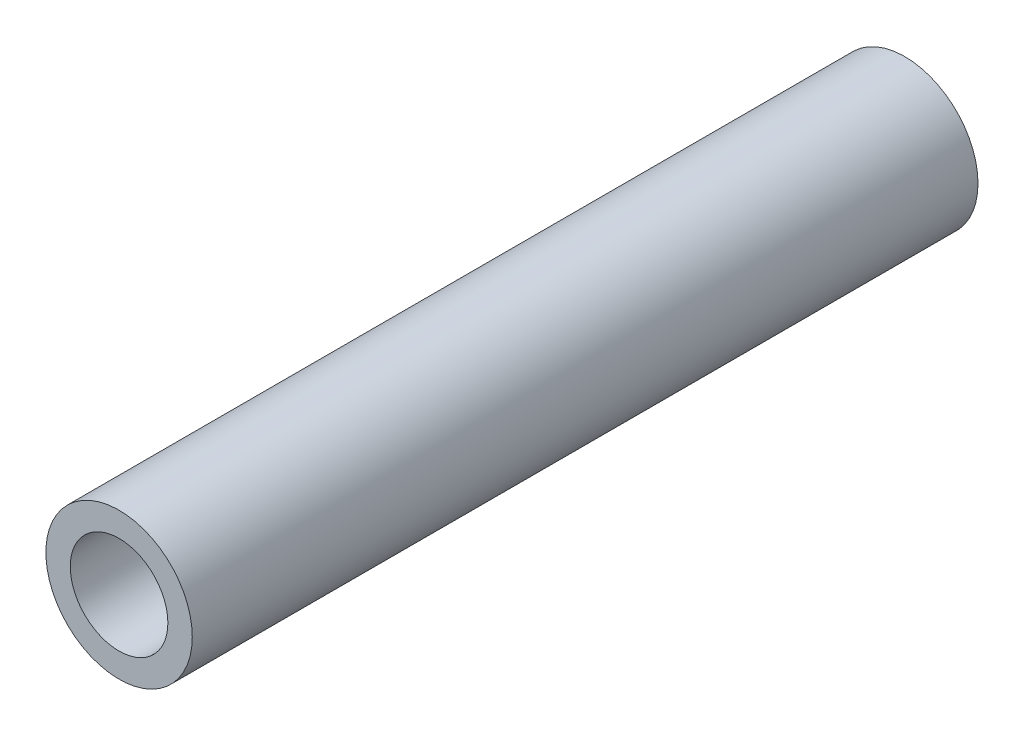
ISO-10303-21;
HEADER;
FILE_DESCRIPTION(('STEP AP214'),'2;1');
FILE_NAME('part.step','',(''),(''),'','','');
FILE_SCHEMA(('AUTOMOTIVE_DESIGN { 1 0 10303 214 1 1 1 1 }'));
ENDSEC;
DATA;
#1=APPLICATION_CONTEXT('core data for automotive mechanical design processes');
#2=APPLICATION_PROTOCOL_DEFINITION('international standard','automotive_design',2000,#1);
#3=PRODUCT_CONTEXT('',#1,'mechanical');
#4=PRODUCT('Part','Part','',(#3));
#5=PRODUCT_RELATED_PRODUCT_CATEGORY('part','',(#4));
#6=PRODUCT_DEFINITION_FORMATION('','',#4);
#7=PRODUCT_DEFINITION_CONTEXT('part definition',#1,'design');
#8=PRODUCT_DEFINITION('design','',#6,#7);
#9=PRODUCT_DEFINITION_SHAPE('','',#8);
#10=(LENGTH_UNIT() NAMED_UNIT(*) SI_UNIT(.MILLI.,.METRE.));
#11=(NAMED_UNIT(*) PLANE_ANGLE_UNIT() SI_UNIT($,.RADIAN.));
#12=(NAMED_UNIT(*) SI_UNIT($,.STERADIAN.) SOLID_ANGLE_UNIT());
#13=UNCERTAINTY_MEASURE_WITH_UNIT(LENGTH_MEASURE(1.E-05),#10,'distance_accuracy_value','');
#14=(GEOMETRIC_REPRESENTATION_CONTEXT(3) GLOBAL_UNCERTAINTY_ASSIGNED_CONTEXT((#13)) GLOBAL_UNIT_ASSIGNED_CONTEXT((#10,
#11,#12)) REPRESENTATION_CONTEXT('',''));
#15=CARTESIAN_POINT('',(0.,0.,0.));
#16=DIRECTION('',(0.,0.,1.));
#17=DIRECTION('',(1.,0.,0.));
#18=AXIS2_PLACEMENT_3D('',#15,#16,#17);
#19=CARTESIAN_POINT('',(0.,0.,16.1));
#20=DIRECTION('',(0.,0.,1.));
#21=DIRECTION('',(1.,0.,0.));
#22=AXIS2_PLACEMENT_3D('',#19,#20,#21);
#23=PLANE('',#22);
#24=CARTESIAN_POINT('',(0.,0.,16.1));
#25=DIRECTION('',(0.,0.,1.));
#26=DIRECTION('',(1.,0.,0.));
#27=AXIS2_PLACEMENT_3D('',#24,#25,#26);
#28=CIRCLE('',#27,1.5);
#29=CARTESIAN_POINT('',(1.5,0.,16.1));
#30=VERTEX_POINT('',#29);
#31=EDGE_CURVE('E10',#30,#30,#28,.T.);
#32=ORIENTED_EDGE('',*,*,#31,.T.);
#33=EDGE_LOOP('',(#32));
#34=FACE_BOUND('',#33,.T.);
#35=CARTESIAN_POINT('',(0.,0.,16.1));
#36=DIRECTION('',(0.,0.,1.));
#37=DIRECTION('',(1.,0.,0.));
#38=AXIS2_PLACEMENT_3D('',#35,#36,#37);
#39=CIRCLE('',#38,1.);
#40=CARTESIAN_POINT('',(1.,0.,16.1));
#41=VERTEX_POINT('',#40);
#42=EDGE_CURVE('E42',#41,#41,#39,.T.);
#43=ORIENTED_EDGE('',*,*,#42,.F.);
#44=EDGE_LOOP('',(#43));
#45=FACE_BOUND('',#44,.T.);
#46=ADVANCED_FACE('F31',(#34,#45),#23,.T.);
#47=CARTESIAN_POINT('',(0.,0.,0.));
#48=DIRECTION('',(0.,0.,1.));
#49=DIRECTION('',(1.,0.,0.));
#50=AXIS2_PLACEMENT_3D('',#47,#48,#49);
#51=PLANE('',#50);
#52=CARTESIAN_POINT('',(0.,0.,0.));
#53=DIRECTION('',(0.,0.,1.));
#54=DIRECTION('',(1.,0.,0.));
#55=AXIS2_PLACEMENT_3D('',#52,#53,#54);
#56=CIRCLE('',#55,1.5);
#57=CARTESIAN_POINT('',(1.5,0.,0.));
#58=VERTEX_POINT('',#57);
#59=EDGE_CURVE('E35',#58,#58,#56,.T.);
#60=ORIENTED_EDGE('',*,*,#59,.F.);
#61=EDGE_LOOP('',(#60));
#62=FACE_BOUND('',#61,.T.);
#63=CARTESIAN_POINT('',(0.,0.,0.));
#64=DIRECTION('',(0.,0.,1.));
#65=DIRECTION('',(1.,0.,0.));
#66=AXIS2_PLACEMENT_3D('',#63,#64,#65);
#67=CIRCLE('',#66,1.);
#68=CARTESIAN_POINT('',(1.,0.,0.));
#69=VERTEX_POINT('',#68);
#70=EDGE_CURVE('E44',#69,#69,#67,.T.);
#71=ORIENTED_EDGE('',*,*,#70,.T.);
#72=EDGE_LOOP('',(#71));
#73=FACE_BOUND('',#72,.T.);
#74=ADVANCED_FACE('F54',(#62,#73),#51,.F.);
#75=CARTESIAN_POINT('',(0.,0.,16.1));
#76=DIRECTION('',(0.,0.,-1.));
#77=DIRECTION('',(-1.,0.,0.));
#78=AXIS2_PLACEMENT_3D('',#75,#76,#77);
#79=CYLINDRICAL_SURFACE('',#78,1.5);
#80=ORIENTED_EDGE('',*,*,#31,.F.);
#81=EDGE_LOOP('',(#80));
#82=FACE_BOUND('',#81,.T.);
#83=ORIENTED_EDGE('',*,*,#59,.T.);
#84=EDGE_LOOP('',(#83));
#85=FACE_BOUND('',#84,.T.);
#86=ADVANCED_FACE('F33',(#82,#85),#79,.T.);
#87=CARTESIAN_POINT('',(0.,0.,16.1));
#88=DIRECTION('',(0.,0.,-1.));
#89=DIRECTION('',(-1.,0.,0.));
#90=AXIS2_PLACEMENT_3D('',#87,#88,#89);
#91=CYLINDRICAL_SURFACE('',#90,1.);
#92=ORIENTED_EDGE('',*,*,#42,.T.);
#93=EDGE_LOOP('',(#92));
#94=FACE_BOUND('',#93,.T.);
#95=ORIENTED_EDGE('',*,*,#70,.F.);
#96=EDGE_LOOP('',(#95));
#97=FACE_BOUND('',#96,.T.);
#98=ADVANCED_FACE('F50',(#94,#97),#91,.F.);
#99=CLOSED_SHELL('',(#46,#74,#86,#98));
#100=MANIFOLD_SOLID_BREP('B2',#99);
#101=ADVANCED_BREP_SHAPE_REPRESENTATION('',(#18,#100),#14);
#102=SHAPE_DEFINITION_REPRESENTATION(#9,#101);
ENDSEC;
END-ISO-10303-21;
